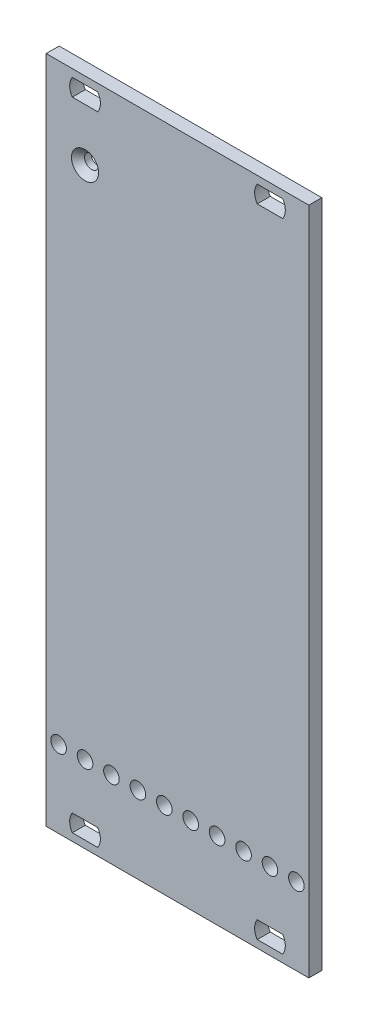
ISO-10303-21;
HEADER;
FILE_DESCRIPTION(('STEP AP214'),'2;1');
FILE_NAME('part.step','',(''),(''),'','','');
FILE_SCHEMA(('AUTOMOTIVE_DESIGN { 1 0 10303 214 1 1 1 1 }'));
ENDSEC;
DATA;
#1=APPLICATION_CONTEXT('core data for automotive mechanical design processes');
#2=APPLICATION_PROTOCOL_DEFINITION('international standard','automotive_design',2000,#1);
#3=PRODUCT_CONTEXT('',#1,'mechanical');
#4=PRODUCT('Part','Part','',(#3));
#5=PRODUCT_RELATED_PRODUCT_CATEGORY('part','',(#4));
#6=PRODUCT_DEFINITION_FORMATION('','',#4);
#7=PRODUCT_DEFINITION_CONTEXT('part definition',#1,'design');
#8=PRODUCT_DEFINITION('design','',#6,#7);
#9=PRODUCT_DEFINITION_SHAPE('','',#8);
#10=(LENGTH_UNIT() NAMED_UNIT(*) SI_UNIT(.MILLI.,.METRE.));
#11=(NAMED_UNIT(*) PLANE_ANGLE_UNIT() SI_UNIT($,.RADIAN.));
#12=(NAMED_UNIT(*) SI_UNIT($,.STERADIAN.) SOLID_ANGLE_UNIT());
#13=UNCERTAINTY_MEASURE_WITH_UNIT(LENGTH_MEASURE(1.E-05),#10,'distance_accuracy_value','');
#14=(GEOMETRIC_REPRESENTATION_CONTEXT(3) GLOBAL_UNCERTAINTY_ASSIGNED_CONTEXT((#13)) GLOBAL_UNIT_ASSIGNED_CONTEXT((#10,
#11,#12)) REPRESENTATION_CONTEXT('',''));
#15=CARTESIAN_POINT('',(0.,0.,0.));
#16=DIRECTION('',(0.,0.,1.));
#17=DIRECTION('',(1.,0.,0.));
#18=AXIS2_PLACEMENT_3D('',#15,#16,#17);
#19=CARTESIAN_POINT('',(25.25,64.35,-2.5));
#20=DIRECTION('',(1.,0.,0.));
#21=DIRECTION('',(0.,1.,0.));
#22=AXIS2_PLACEMENT_3D('',#19,#20,#21);
#23=PLANE('',#22);
#24=DIRECTION('',(0.,1.,0.));
#25=VECTOR('',#24,1.);
#26=CARTESIAN_POINT('',(25.25,64.35,0.));
#27=LINE('',#26,#25);
#28=CARTESIAN_POINT('',(25.25,-64.35,0.));
#29=VERTEX_POINT('',#28);
#30=CARTESIAN_POINT('',(25.25,64.35,0.));
#31=VERTEX_POINT('',#30);
#32=EDGE_CURVE('E336',#29,#31,#27,.T.);
#33=ORIENTED_EDGE('',*,*,#32,.F.);
#34=DIRECTION('',(0.,0.,1.));
#35=VECTOR('',#34,1.);
#36=CARTESIAN_POINT('',(25.25,-64.35,-2.5));
#37=LINE('',#36,#35);
#38=CARTESIAN_POINT('',(25.25,-64.35,-2.5));
#39=VERTEX_POINT('',#38);
#40=EDGE_CURVE('E361',#39,#29,#37,.T.);
#41=ORIENTED_EDGE('',*,*,#40,.F.);
#42=DIRECTION('',(0.,1.,0.));
#43=VECTOR('',#42,1.);
#44=CARTESIAN_POINT('',(25.25,64.35,-2.5));
#45=LINE('',#44,#43);
#46=CARTESIAN_POINT('',(25.25,64.35,-2.5));
#47=VERTEX_POINT('',#46);
#48=EDGE_CURVE('E337',#39,#47,#45,.T.);
#49=ORIENTED_EDGE('',*,*,#48,.T.);
#50=DIRECTION('',(0.,0.,1.));
#51=VECTOR('',#50,1.);
#52=CARTESIAN_POINT('',(25.25,64.35,-2.5));
#53=LINE('',#52,#51);
#54=EDGE_CURVE('E350',#47,#31,#53,.T.);
#55=ORIENTED_EDGE('',*,*,#54,.T.);
#56=EDGE_LOOP('',(#33,#41,#49,#55));
#57=FACE_BOUND('',#56,.T.);
#58=ADVANCED_FACE('F34',(#57),#23,.T.);
#59=CARTESIAN_POINT('',(-25.25,-64.35,-2.5));
#60=DIRECTION('',(0.,-1.,0.));
#61=DIRECTION('',(0.,0.,-1.));
#62=AXIS2_PLACEMENT_3D('',#59,#60,#61);
#63=PLANE('',#62);
#64=DIRECTION('',(1.,0.,0.));
#65=VECTOR('',#64,1.);
#66=CARTESIAN_POINT('',(-25.25,-64.35,0.));
#67=LINE('',#66,#65);
#68=CARTESIAN_POINT('',(-25.25,-64.35,0.));
#69=VERTEX_POINT('',#68);
#70=EDGE_CURVE('E341',#69,#29,#67,.T.);
#71=ORIENTED_EDGE('',*,*,#70,.F.);
#72=DIRECTION('',(0.,0.,1.));
#73=VECTOR('',#72,1.);
#74=CARTESIAN_POINT('',(-25.25,-64.35,-2.5));
#75=LINE('',#74,#73);
#76=CARTESIAN_POINT('',(-25.25,-64.35,-2.5));
#77=VERTEX_POINT('',#76);
#78=EDGE_CURVE('E363',#77,#69,#75,.T.);
#79=ORIENTED_EDGE('',*,*,#78,.F.);
#80=DIRECTION('',(1.,0.,0.));
#81=VECTOR('',#80,1.);
#82=CARTESIAN_POINT('',(-25.25,-64.35,-2.5));
#83=LINE('',#82,#81);
#84=EDGE_CURVE('E347',#77,#39,#83,.T.);
#85=ORIENTED_EDGE('',*,*,#84,.T.);
#86=ORIENTED_EDGE('',*,*,#40,.T.);
#87=EDGE_LOOP('',(#71,#79,#85,#86));
#88=FACE_BOUND('',#87,.T.);
#89=ADVANCED_FACE('F382',(#88),#63,.T.);
#90=CARTESIAN_POINT('',(-25.25,64.35,-2.5));
#91=DIRECTION('',(-1.,0.,0.));
#92=DIRECTION('',(0.,-1.,0.));
#93=AXIS2_PLACEMENT_3D('',#90,#91,#92);
#94=PLANE('',#93);
#95=DIRECTION('',(0.,-1.,0.));
#96=VECTOR('',#95,1.);
#97=CARTESIAN_POINT('',(-25.25,64.35,0.));
#98=LINE('',#97,#96);
#99=CARTESIAN_POINT('',(-25.25,64.35,0.));
#100=VERTEX_POINT('',#99);
#101=EDGE_CURVE('E356',#100,#69,#98,.T.);
#102=ORIENTED_EDGE('',*,*,#101,.F.);
#103=DIRECTION('',(0.,0.,1.));
#104=VECTOR('',#103,1.);
#105=CARTESIAN_POINT('',(-25.25,64.35,-2.5));
#106=LINE('',#105,#104);
#107=CARTESIAN_POINT('',(-25.25,64.35,-2.5));
#108=VERTEX_POINT('',#107);
#109=EDGE_CURVE('E365',#108,#100,#106,.T.);
#110=ORIENTED_EDGE('',*,*,#109,.F.);
#111=DIRECTION('',(0.,-1.,0.));
#112=VECTOR('',#111,1.);
#113=CARTESIAN_POINT('',(-25.25,64.35,-2.5));
#114=LINE('',#113,#112);
#115=EDGE_CURVE('E344',#108,#77,#114,.T.);
#116=ORIENTED_EDGE('',*,*,#115,.T.);
#117=ORIENTED_EDGE('',*,*,#78,.T.);
#118=EDGE_LOOP('',(#102,#110,#116,#117));
#119=FACE_BOUND('',#118,.T.);
#120=ADVANCED_FACE('F387',(#119),#94,.T.);
#121=CARTESIAN_POINT('',(-25.25,64.35,-2.5));
#122=DIRECTION('',(0.,1.,0.));
#123=DIRECTION('',(0.,0.,1.));
#124=AXIS2_PLACEMENT_3D('',#121,#122,#123);
#125=PLANE('',#124);
#126=DIRECTION('',(-1.,0.,0.));
#127=VECTOR('',#126,1.);
#128=CARTESIAN_POINT('',(-25.25,64.35,0.));
#129=LINE('',#128,#127);
#130=EDGE_CURVE('E353',#31,#100,#129,.T.);
#131=ORIENTED_EDGE('',*,*,#130,.F.);
#132=ORIENTED_EDGE('',*,*,#54,.F.);
#133=DIRECTION('',(-1.,0.,0.));
#134=VECTOR('',#133,1.);
#135=CARTESIAN_POINT('',(-25.25,64.35,-2.5));
#136=LINE('',#135,#134);
#137=EDGE_CURVE('E340',#47,#108,#136,.T.);
#138=ORIENTED_EDGE('',*,*,#137,.T.);
#139=ORIENTED_EDGE('',*,*,#109,.T.);
#140=EDGE_LOOP('',(#131,#132,#138,#139));
#141=FACE_BOUND('',#140,.T.);
#142=ADVANCED_FACE('F392',(#141),#125,.T.);
#143=CARTESIAN_POINT('',(0.,0.,-2.5));
#144=DIRECTION('',(0.,0.,1.));
#145=DIRECTION('',(1.,0.,0.));
#146=AXIS2_PLACEMENT_3D('',#143,#144,#145);
#147=PLANE('',#146);
#148=CARTESIAN_POINT('',(-17.78,49.5,-2.5));
#149=DIRECTION('',(0.,0.,1.));
#150=DIRECTION('',(1.,0.,0.));
#151=AXIS2_PLACEMENT_3D('',#148,#149,#150);
#152=CIRCLE('',#151,1.35);
#153=CARTESIAN_POINT('',(-16.43,49.5,-2.5));
#154=VERTEX_POINT('',#153);
#155=EDGE_CURVE('E518',#154,#154,#152,.F.);
#156=ORIENTED_EDGE('',*,*,#155,.F.);
#157=EDGE_LOOP('',(#156));
#158=FACE_BOUND('',#157,.T.);
#159=CARTESIAN_POINT('',(7.62000000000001,-49.5,-2.5));
#160=DIRECTION('',(0.,0.,1.));
#161=DIRECTION('',(1.,0.,0.));
#162=AXIS2_PLACEMENT_3D('',#159,#160,#161);
#163=CIRCLE('',#162,1.5);
#164=CARTESIAN_POINT('',(9.12000000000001,-49.5,-2.5));
#165=VERTEX_POINT('',#164);
#166=EDGE_CURVE('E511',#165,#165,#163,.F.);
#167=ORIENTED_EDGE('',*,*,#166,.F.);
#168=EDGE_LOOP('',(#167));
#169=FACE_BOUND('',#168,.T.);
#170=CARTESIAN_POINT('',(2.54000000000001,-49.5,-2.5));
#171=DIRECTION('',(0.,0.,1.));
#172=DIRECTION('',(1.,0.,0.));
#173=AXIS2_PLACEMENT_3D('',#170,#171,#172);
#174=CIRCLE('',#173,1.5);
#175=CARTESIAN_POINT('',(4.04000000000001,-49.5,-2.5));
#176=VERTEX_POINT('',#175);
#177=EDGE_CURVE('E516',#176,#176,#174,.F.);
#178=ORIENTED_EDGE('',*,*,#177,.F.);
#179=EDGE_LOOP('',(#178));
#180=FACE_BOUND('',#179,.T.);
#181=CARTESIAN_POINT('',(-2.53999999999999,-49.5,-2.5));
#182=DIRECTION('',(0.,0.,1.));
#183=DIRECTION('',(1.,0.,0.));
#184=AXIS2_PLACEMENT_3D('',#181,#182,#183);
#185=CIRCLE('',#184,1.5);
#186=CARTESIAN_POINT('',(-1.03999999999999,-49.5,-2.5));
#187=VERTEX_POINT('',#186);
#188=EDGE_CURVE('E527',#187,#187,#185,.F.);
#189=ORIENTED_EDGE('',*,*,#188,.F.);
#190=EDGE_LOOP('',(#189));
#191=FACE_BOUND('',#190,.T.);
#192=CARTESIAN_POINT('',(-7.61999999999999,-49.5,-2.5));
#193=DIRECTION('',(0.,0.,1.));
#194=DIRECTION('',(1.,0.,0.));
#195=AXIS2_PLACEMENT_3D('',#192,#193,#194);
#196=CIRCLE('',#195,1.5);
#197=CARTESIAN_POINT('',(-6.11999999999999,-49.5,-2.5));
#198=VERTEX_POINT('',#197);
#199=EDGE_CURVE('E533',#198,#198,#196,.F.);
#200=ORIENTED_EDGE('',*,*,#199,.F.);
#201=EDGE_LOOP('',(#200));
#202=FACE_BOUND('',#201,.T.);
#203=DIRECTION('',(-1.,0.,0.));
#204=VECTOR('',#203,1.);
#205=CARTESIAN_POINT('',(-20.2254038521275,-62.9,-2.5));
#206=LINE('',#205,#204);
#207=CARTESIAN_POINT('',(-15.3345961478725,-62.9,-2.5));
#208=VERTEX_POINT('',#207);
#209=CARTESIAN_POINT('',(-20.2254038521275,-62.9,-2.5));
#210=VERTEX_POINT('',#209);
#211=EDGE_CURVE('E191',#208,#210,#206,.T.);
#212=ORIENTED_EDGE('',*,*,#211,.F.);
#213=CARTESIAN_POINT('',(-17.78,-61.25,-2.5));
#214=DIRECTION('',(0.,0.,1.));
#215=DIRECTION('',(1.,0.,0.));
#216=AXIS2_PLACEMENT_3D('',#213,#214,#215);
#217=CIRCLE('',#216,2.95);
#218=CARTESIAN_POINT('',(-15.3345961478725,-59.6,-2.5));
#219=VERTEX_POINT('',#218);
#220=EDGE_CURVE('E173',#219,#208,#217,.F.);
#221=ORIENTED_EDGE('',*,*,#220,.F.);
#222=DIRECTION('',(1.,0.,0.));
#223=VECTOR('',#222,1.);
#224=CARTESIAN_POINT('',(-20.2254038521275,-59.6,-2.5));
#225=LINE('',#224,#223);
#226=CARTESIAN_POINT('',(-20.2254038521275,-59.6,-2.5));
#227=VERTEX_POINT('',#226);
#228=EDGE_CURVE('E182',#227,#219,#225,.T.);
#229=ORIENTED_EDGE('',*,*,#228,.F.);
#230=CARTESIAN_POINT('',(-17.78,-61.25,-2.5));
#231=DIRECTION('',(0.,0.,1.));
#232=DIRECTION('',(1.,0.,0.));
#233=AXIS2_PLACEMENT_3D('',#230,#231,#232);
#234=CIRCLE('',#233,2.95);
#235=EDGE_CURVE('E49',#210,#227,#234,.F.);
#236=ORIENTED_EDGE('',*,*,#235,.F.);
#237=EDGE_LOOP('',(#212,#221,#229,#236));
#238=FACE_BOUND('',#237,.T.);
#239=DIRECTION('',(-1.,0.,0.));
#240=VECTOR('',#239,1.);
#241=CARTESIAN_POINT('',(20.2254038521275,-62.9,-2.5));
#242=LINE('',#241,#240);
#243=CARTESIAN_POINT('',(20.2254038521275,-62.9,-2.5));
#244=VERTEX_POINT('',#243);
#245=CARTESIAN_POINT('',(15.3345961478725,-62.9,-2.5));
#246=VERTEX_POINT('',#245);
#247=EDGE_CURVE('E209',#244,#246,#242,.T.);
#248=ORIENTED_EDGE('',*,*,#247,.F.);
#249=CARTESIAN_POINT('',(17.78,-61.25,-2.5));
#250=DIRECTION('',(0.,0.,1.));
#251=DIRECTION('',(1.,0.,0.));
#252=AXIS2_PLACEMENT_3D('',#249,#250,#251);
#253=CIRCLE('',#252,2.95);
#254=CARTESIAN_POINT('',(20.2254038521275,-59.6,-2.5));
#255=VERTEX_POINT('',#254);
#256=EDGE_CURVE('E212',#255,#244,#253,.F.);
#257=ORIENTED_EDGE('',*,*,#256,.F.);
#258=DIRECTION('',(1.,0.,0.));
#259=VECTOR('',#258,1.);
#260=CARTESIAN_POINT('',(20.2254038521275,-59.6,-2.5));
#261=LINE('',#260,#259);
#262=CARTESIAN_POINT('',(15.3345961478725,-59.6,-2.5));
#263=VERTEX_POINT('',#262);
#264=EDGE_CURVE('E229',#263,#255,#261,.T.);
#265=ORIENTED_EDGE('',*,*,#264,.F.);
#266=CARTESIAN_POINT('',(17.78,-61.25,-2.5));
#267=DIRECTION('',(0.,0.,1.));
#268=DIRECTION('',(1.,0.,0.));
#269=AXIS2_PLACEMENT_3D('',#266,#267,#268);
#270=CIRCLE('',#269,2.95);
#271=EDGE_CURVE('E185',#246,#263,#270,.F.);
#272=ORIENTED_EDGE('',*,*,#271,.F.);
#273=EDGE_LOOP('',(#248,#257,#265,#272));
#274=FACE_BOUND('',#273,.T.);
#275=DIRECTION('',(-1.,0.,0.));
#276=VECTOR('',#275,1.);
#277=CARTESIAN_POINT('',(-20.2254038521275,59.6,-2.5));
#278=LINE('',#277,#276);
#279=CARTESIAN_POINT('',(-15.3345961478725,59.6,-2.5));
#280=VERTEX_POINT('',#279);
#281=CARTESIAN_POINT('',(-20.2254038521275,59.6,-2.5));
#282=VERTEX_POINT('',#281);
#283=EDGE_CURVE('E240',#280,#282,#278,.T.);
#284=ORIENTED_EDGE('',*,*,#283,.F.);
#285=CARTESIAN_POINT('',(-17.78,61.25,-2.5));
#286=DIRECTION('',(0.,0.,1.));
#287=DIRECTION('',(1.,0.,0.));
#288=AXIS2_PLACEMENT_3D('',#285,#286,#287);
#289=CIRCLE('',#288,2.95);
#290=CARTESIAN_POINT('',(-15.3345961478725,62.9,-2.5));
#291=VERTEX_POINT('',#290);
#292=EDGE_CURVE('E243',#291,#280,#289,.F.);
#293=ORIENTED_EDGE('',*,*,#292,.F.);
#294=DIRECTION('',(1.,0.,0.));
#295=VECTOR('',#294,1.);
#296=CARTESIAN_POINT('',(-20.2254038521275,62.9,-2.5));
#297=LINE('',#296,#295);
#298=CARTESIAN_POINT('',(-20.2254038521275,62.9,-2.5));
#299=VERTEX_POINT('',#298);
#300=EDGE_CURVE('E260',#299,#291,#297,.T.);
#301=ORIENTED_EDGE('',*,*,#300,.F.);
#302=CARTESIAN_POINT('',(-17.78,61.25,-2.5));
#303=DIRECTION('',(0.,0.,1.));
#304=DIRECTION('',(1.,0.,0.));
#305=AXIS2_PLACEMENT_3D('',#302,#303,#304);
#306=CIRCLE('',#305,2.95);
#307=EDGE_CURVE('E238',#282,#299,#306,.F.);
#308=ORIENTED_EDGE('',*,*,#307,.F.);
#309=EDGE_LOOP('',(#284,#293,#301,#308));
#310=FACE_BOUND('',#309,.T.);
#311=DIRECTION('',(1.,0.,0.));
#312=VECTOR('',#311,1.);
#313=CARTESIAN_POINT('',(20.2254038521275,62.9,-2.5));
#314=LINE('',#313,#312);
#315=CARTESIAN_POINT('',(15.3345961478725,62.9,-2.5));
#316=VERTEX_POINT('',#315);
#317=CARTESIAN_POINT('',(20.2254038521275,62.9,-2.5));
#318=VERTEX_POINT('',#317);
#319=EDGE_CURVE('E271',#316,#318,#314,.T.);
#320=ORIENTED_EDGE('',*,*,#319,.F.);
#321=CARTESIAN_POINT('',(17.78,61.25,-2.5));
#322=DIRECTION('',(0.,0.,1.));
#323=DIRECTION('',(1.,0.,0.));
#324=AXIS2_PLACEMENT_3D('',#321,#322,#323);
#325=CIRCLE('',#324,2.95);
#326=CARTESIAN_POINT('',(15.3345961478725,59.6,-2.5));
#327=VERTEX_POINT('',#326);
#328=EDGE_CURVE('E274',#327,#316,#325,.F.);
#329=ORIENTED_EDGE('',*,*,#328,.F.);
#330=DIRECTION('',(-1.,0.,0.));
#331=VECTOR('',#330,1.);
#332=CARTESIAN_POINT('',(20.2254038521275,59.6,-2.5));
#333=LINE('',#332,#331);
#334=CARTESIAN_POINT('',(20.2254038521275,59.6,-2.5));
#335=VERTEX_POINT('',#334);
#336=EDGE_CURVE('E291',#335,#327,#333,.T.);
#337=ORIENTED_EDGE('',*,*,#336,.F.);
#338=CARTESIAN_POINT('',(17.78,61.25,-2.5));
#339=DIRECTION('',(0.,0.,1.));
#340=DIRECTION('',(1.,0.,0.));
#341=AXIS2_PLACEMENT_3D('',#338,#339,#340);
#342=CIRCLE('',#341,2.95);
#343=EDGE_CURVE('E269',#318,#335,#342,.F.);
#344=ORIENTED_EDGE('',*,*,#343,.F.);
#345=EDGE_LOOP('',(#320,#329,#337,#344));
#346=FACE_BOUND('',#345,.T.);
#347=CARTESIAN_POINT('',(17.78,-49.5,-2.5));
#348=DIRECTION('',(0.,0.,1.));
#349=DIRECTION('',(1.,0.,0.));
#350=AXIS2_PLACEMENT_3D('',#347,#348,#349);
#351=CIRCLE('',#350,1.5);
#352=CARTESIAN_POINT('',(19.28,-49.5,-2.5));
#353=VERTEX_POINT('',#352);
#354=EDGE_CURVE('E303',#353,#353,#351,.F.);
#355=ORIENTED_EDGE('',*,*,#354,.F.);
#356=EDGE_LOOP('',(#355));
#357=FACE_BOUND('',#356,.T.);
#358=CARTESIAN_POINT('',(22.86,-49.5,-2.5));
#359=DIRECTION('',(0.,0.,1.));
#360=DIRECTION('',(1.,0.,0.));
#361=AXIS2_PLACEMENT_3D('',#358,#359,#360);
#362=CIRCLE('',#361,1.5);
#363=CARTESIAN_POINT('',(24.36,-49.5,-2.5));
#364=VERTEX_POINT('',#363);
#365=EDGE_CURVE('E309',#364,#364,#362,.F.);
#366=ORIENTED_EDGE('',*,*,#365,.F.);
#367=EDGE_LOOP('',(#366));
#368=FACE_BOUND('',#367,.T.);
#369=CARTESIAN_POINT('',(12.7,-49.5,-2.5));
#370=DIRECTION('',(0.,0.,1.));
#371=DIRECTION('',(1.,0.,0.));
#372=AXIS2_PLACEMENT_3D('',#369,#370,#371);
#373=CIRCLE('',#372,1.5);
#374=CARTESIAN_POINT('',(14.2,-49.5,-2.5));
#375=VERTEX_POINT('',#374);
#376=EDGE_CURVE('E315',#375,#375,#373,.F.);
#377=ORIENTED_EDGE('',*,*,#376,.F.);
#378=EDGE_LOOP('',(#377));
#379=FACE_BOUND('',#378,.T.);
#380=CARTESIAN_POINT('',(-12.7,-49.5,-2.5));
#381=DIRECTION('',(0.,0.,1.));
#382=DIRECTION('',(1.,0.,0.));
#383=AXIS2_PLACEMENT_3D('',#380,#381,#382);
#384=CIRCLE('',#383,1.5);
#385=CARTESIAN_POINT('',(-11.2,-49.5,-2.5));
#386=VERTEX_POINT('',#385);
#387=EDGE_CURVE('E321',#386,#386,#384,.F.);
#388=ORIENTED_EDGE('',*,*,#387,.F.);
#389=EDGE_LOOP('',(#388));
#390=FACE_BOUND('',#389,.T.);
#391=CARTESIAN_POINT('',(-22.86,-49.5,-2.5));
#392=DIRECTION('',(0.,0.,1.));
#393=DIRECTION('',(1.,0.,0.));
#394=AXIS2_PLACEMENT_3D('',#391,#392,#393);
#395=CIRCLE('',#394,1.5);
#396=CARTESIAN_POINT('',(-21.36,-49.5,-2.5));
#397=VERTEX_POINT('',#396);
#398=EDGE_CURVE('E327',#397,#397,#395,.F.);
#399=ORIENTED_EDGE('',*,*,#398,.F.);
#400=EDGE_LOOP('',(#399));
#401=FACE_BOUND('',#400,.T.);
#402=CARTESIAN_POINT('',(-17.78,-49.5,-2.5));
#403=DIRECTION('',(0.,0.,1.));
#404=DIRECTION('',(1.,0.,0.));
#405=AXIS2_PLACEMENT_3D('',#402,#403,#404);
#406=CIRCLE('',#405,1.5);
#407=CARTESIAN_POINT('',(-16.28,-49.5,-2.5));
#408=VERTEX_POINT('',#407);
#409=EDGE_CURVE('E333',#408,#408,#406,.F.);
#410=ORIENTED_EDGE('',*,*,#409,.F.);
#411=EDGE_LOOP('',(#410));
#412=FACE_BOUND('',#411,.T.);
#413=ORIENTED_EDGE('',*,*,#48,.F.);
#414=ORIENTED_EDGE('',*,*,#84,.F.);
#415=ORIENTED_EDGE('',*,*,#115,.F.);
#416=ORIENTED_EDGE('',*,*,#137,.F.);
#417=EDGE_LOOP('',(#413,#414,#415,#416));
#418=FACE_BOUND('',#417,.T.);
#419=ADVANCED_FACE('F188',(#158,#169,#180,#191,#202,#238,#274,#310,#346,#357,#368,#379,#390,
#401,#412,#418),#147,.F.);
#420=CARTESIAN_POINT('',(0.,0.,0.));
#421=DIRECTION('',(0.,0.,1.));
#422=DIRECTION('',(1.,0.,0.));
#423=AXIS2_PLACEMENT_3D('',#420,#421,#422);
#424=PLANE('',#423);
#425=CARTESIAN_POINT('',(-17.78,49.5,0.));
#426=DIRECTION('',(0.,0.,1.));
#427=DIRECTION('',(1.,0.,0.));
#428=AXIS2_PLACEMENT_3D('',#425,#426,#427);
#429=CIRCLE('',#428,2.60000000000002);
#430=CARTESIAN_POINT('',(-15.18,49.5,0.));
#431=VERTEX_POINT('',#430);
#432=EDGE_CURVE('E11',#431,#431,#429,.F.);
#433=ORIENTED_EDGE('',*,*,#432,.T.);
#434=EDGE_LOOP('',(#433));
#435=FACE_BOUND('',#434,.T.);
#436=CARTESIAN_POINT('',(7.62000000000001,-49.5,0.));
#437=DIRECTION('',(0.,0.,1.));
#438=DIRECTION('',(1.,0.,0.));
#439=AXIS2_PLACEMENT_3D('',#436,#437,#438);
#440=CIRCLE('',#439,1.5);
#441=CARTESIAN_POINT('',(9.12000000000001,-49.5,0.));
#442=VERTEX_POINT('',#441);
#443=EDGE_CURVE('E508',#442,#442,#440,.T.);
#444=ORIENTED_EDGE('',*,*,#443,.F.);
#445=EDGE_LOOP('',(#444));
#446=FACE_BOUND('',#445,.T.);
#447=CARTESIAN_POINT('',(2.54000000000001,-49.5,0.));
#448=DIRECTION('',(0.,0.,1.));
#449=DIRECTION('',(1.,0.,0.));
#450=AXIS2_PLACEMENT_3D('',#447,#448,#449);
#451=CIRCLE('',#450,1.5);
#452=CARTESIAN_POINT('',(4.04000000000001,-49.5,0.));
#453=VERTEX_POINT('',#452);
#454=EDGE_CURVE('E513',#453,#453,#451,.T.);
#455=ORIENTED_EDGE('',*,*,#454,.F.);
#456=EDGE_LOOP('',(#455));
#457=FACE_BOUND('',#456,.T.);
#458=CARTESIAN_POINT('',(-2.53999999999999,-49.5,0.));
#459=DIRECTION('',(0.,0.,1.));
#460=DIRECTION('',(1.,0.,0.));
#461=AXIS2_PLACEMENT_3D('',#458,#459,#460);
#462=CIRCLE('',#461,1.5);
#463=CARTESIAN_POINT('',(-1.03999999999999,-49.5,0.));
#464=VERTEX_POINT('',#463);
#465=EDGE_CURVE('E524',#464,#464,#462,.T.);
#466=ORIENTED_EDGE('',*,*,#465,.F.);
#467=EDGE_LOOP('',(#466));
#468=FACE_BOUND('',#467,.T.);
#469=CARTESIAN_POINT('',(-7.61999999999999,-49.5,0.));
#470=DIRECTION('',(0.,0.,1.));
#471=DIRECTION('',(1.,0.,0.));
#472=AXIS2_PLACEMENT_3D('',#469,#470,#471);
#473=CIRCLE('',#472,1.5);
#474=CARTESIAN_POINT('',(-6.11999999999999,-49.5,0.));
#475=VERTEX_POINT('',#474);
#476=EDGE_CURVE('E530',#475,#475,#473,.T.);
#477=ORIENTED_EDGE('',*,*,#476,.F.);
#478=EDGE_LOOP('',(#477));
#479=FACE_BOUND('',#478,.T.);
#480=CARTESIAN_POINT('',(-17.78,-61.25,0.));
#481=DIRECTION('',(0.,0.,1.));
#482=DIRECTION('',(-1.,0.,0.));
#483=AXIS2_PLACEMENT_3D('',#480,#481,#482);
#484=CIRCLE('',#483,2.95);
#485=CARTESIAN_POINT('',(-15.3345961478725,-62.9,0.));
#486=VERTEX_POINT('',#485);
#487=CARTESIAN_POINT('',(-15.3345961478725,-59.6,0.));
#488=VERTEX_POINT('',#487);
#489=EDGE_CURVE('E57',#486,#488,#484,.T.);
#490=ORIENTED_EDGE('',*,*,#489,.F.);
#491=DIRECTION('',(1.,0.,0.));
#492=VECTOR('',#491,1.);
#493=CARTESIAN_POINT('',(-20.2254038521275,-62.9,0.));
#494=LINE('',#493,#492);
#495=CARTESIAN_POINT('',(-20.2254038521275,-62.9,0.));
#496=VERTEX_POINT('',#495);
#497=EDGE_CURVE('E179',#496,#486,#494,.T.);
#498=ORIENTED_EDGE('',*,*,#497,.F.);
#499=CARTESIAN_POINT('',(-17.78,-61.25,0.));
#500=DIRECTION('',(0.,0.,1.));
#501=DIRECTION('',(-1.,0.,0.));
#502=AXIS2_PLACEMENT_3D('',#499,#500,#501);
#503=CIRCLE('',#502,2.95);
#504=CARTESIAN_POINT('',(-20.2254038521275,-59.6,0.));
#505=VERTEX_POINT('',#504);
#506=EDGE_CURVE('E199',#505,#496,#503,.T.);
#507=ORIENTED_EDGE('',*,*,#506,.F.);
#508=DIRECTION('',(-1.,0.,0.));
#509=VECTOR('',#508,1.);
#510=CARTESIAN_POINT('',(-20.2254038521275,-59.6,0.));
#511=LINE('',#510,#509);
#512=EDGE_CURVE('E193',#488,#505,#511,.T.);
#513=ORIENTED_EDGE('',*,*,#512,.F.);
#514=EDGE_LOOP('',(#490,#498,#507,#513));
#515=FACE_BOUND('',#514,.T.);
#516=CARTESIAN_POINT('',(17.78,-61.25,0.));
#517=DIRECTION('',(0.,0.,1.));
#518=DIRECTION('',(1.,0.,0.));
#519=AXIS2_PLACEMENT_3D('',#516,#517,#518);
#520=CIRCLE('',#519,2.95);
#521=CARTESIAN_POINT('',(20.2254038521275,-62.9,0.));
#522=VERTEX_POINT('',#521);
#523=CARTESIAN_POINT('',(20.2254038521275,-59.6,0.));
#524=VERTEX_POINT('',#523);
#525=EDGE_CURVE('E215',#522,#524,#520,.T.);
#526=ORIENTED_EDGE('',*,*,#525,.F.);
#527=DIRECTION('',(1.,0.,0.));
#528=VECTOR('',#527,1.);
#529=CARTESIAN_POINT('',(20.2254038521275,-62.9,0.));
#530=LINE('',#529,#528);
#531=CARTESIAN_POINT('',(15.3345961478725,-62.9,0.));
#532=VERTEX_POINT('',#531);
#533=EDGE_CURVE('E223',#532,#522,#530,.T.);
#534=ORIENTED_EDGE('',*,*,#533,.F.);
#535=CARTESIAN_POINT('',(17.78,-61.25,0.));
#536=DIRECTION('',(0.,0.,1.));
#537=DIRECTION('',(1.,0.,0.));
#538=AXIS2_PLACEMENT_3D('',#535,#536,#537);
#539=CIRCLE('',#538,2.95);
#540=CARTESIAN_POINT('',(15.3345961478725,-59.6,0.));
#541=VERTEX_POINT('',#540);
#542=EDGE_CURVE('E220',#541,#532,#539,.T.);
#543=ORIENTED_EDGE('',*,*,#542,.F.);
#544=DIRECTION('',(-1.,0.,0.));
#545=VECTOR('',#544,1.);
#546=CARTESIAN_POINT('',(20.2254038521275,-59.6,0.));
#547=LINE('',#546,#545);
#548=EDGE_CURVE('E217',#524,#541,#547,.T.);
#549=ORIENTED_EDGE('',*,*,#548,.F.);
#550=EDGE_LOOP('',(#526,#534,#543,#549));
#551=FACE_BOUND('',#550,.T.);
#552=CARTESIAN_POINT('',(-17.78,61.25,0.));
#553=DIRECTION('',(0.,0.,1.));
#554=DIRECTION('',(1.,0.,0.));
#555=AXIS2_PLACEMENT_3D('',#552,#553,#554);
#556=CIRCLE('',#555,2.95);
#557=CARTESIAN_POINT('',(-15.3345961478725,59.6,0.));
#558=VERTEX_POINT('',#557);
#559=CARTESIAN_POINT('',(-15.3345961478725,62.9,0.));
#560=VERTEX_POINT('',#559);
#561=EDGE_CURVE('E246',#558,#560,#556,.T.);
#562=ORIENTED_EDGE('',*,*,#561,.F.);
#563=DIRECTION('',(1.,0.,0.));
#564=VECTOR('',#563,1.);
#565=CARTESIAN_POINT('',(-20.2254038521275,59.6,0.));
#566=LINE('',#565,#564);
#567=CARTESIAN_POINT('',(-20.2254038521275,59.6,0.));
#568=VERTEX_POINT('',#567);
#569=EDGE_CURVE('E254',#568,#558,#566,.T.);
#570=ORIENTED_EDGE('',*,*,#569,.F.);
#571=CARTESIAN_POINT('',(-17.78,61.25,0.));
#572=DIRECTION('',(0.,0.,1.));
#573=DIRECTION('',(1.,0.,0.));
#574=AXIS2_PLACEMENT_3D('',#571,#572,#573);
#575=CIRCLE('',#574,2.95);
#576=CARTESIAN_POINT('',(-20.2254038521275,62.9,0.));
#577=VERTEX_POINT('',#576);
#578=EDGE_CURVE('E251',#577,#568,#575,.T.);
#579=ORIENTED_EDGE('',*,*,#578,.F.);
#580=DIRECTION('',(-1.,0.,0.));
#581=VECTOR('',#580,1.);
#582=CARTESIAN_POINT('',(-20.2254038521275,62.9,0.));
#583=LINE('',#582,#581);
#584=EDGE_CURVE('E248',#560,#577,#583,.T.);
#585=ORIENTED_EDGE('',*,*,#584,.F.);
#586=EDGE_LOOP('',(#562,#570,#579,#585));
#587=FACE_BOUND('',#586,.T.);
#588=CARTESIAN_POINT('',(17.78,61.25,0.));
#589=DIRECTION('',(0.,0.,1.));
#590=DIRECTION('',(-1.,0.,0.));
#591=AXIS2_PLACEMENT_3D('',#588,#589,#590);
#592=CIRCLE('',#591,2.95);
#593=CARTESIAN_POINT('',(15.3345961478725,62.9,0.));
#594=VERTEX_POINT('',#593);
#595=CARTESIAN_POINT('',(15.3345961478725,59.6,0.));
#596=VERTEX_POINT('',#595);
#597=EDGE_CURVE('E277',#594,#596,#592,.T.);
#598=ORIENTED_EDGE('',*,*,#597,.F.);
#599=DIRECTION('',(-1.,0.,0.));
#600=VECTOR('',#599,1.);
#601=CARTESIAN_POINT('',(20.2254038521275,62.9,0.));
#602=LINE('',#601,#600);
#603=CARTESIAN_POINT('',(20.2254038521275,62.9,0.));
#604=VERTEX_POINT('',#603);
#605=EDGE_CURVE('E285',#604,#594,#602,.T.);
#606=ORIENTED_EDGE('',*,*,#605,.F.);
#607=CARTESIAN_POINT('',(17.78,61.25,0.));
#608=DIRECTION('',(0.,0.,1.));
#609=DIRECTION('',(-1.,0.,0.));
#610=AXIS2_PLACEMENT_3D('',#607,#608,#609);
#611=CIRCLE('',#610,2.95);
#612=CARTESIAN_POINT('',(20.2254038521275,59.6,0.));
#613=VERTEX_POINT('',#612);
#614=EDGE_CURVE('E282',#613,#604,#611,.T.);
#615=ORIENTED_EDGE('',*,*,#614,.F.);
#616=DIRECTION('',(1.,0.,0.));
#617=VECTOR('',#616,1.);
#618=CARTESIAN_POINT('',(20.2254038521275,59.6,0.));
#619=LINE('',#618,#617);
#620=EDGE_CURVE('E279',#596,#613,#619,.T.);
#621=ORIENTED_EDGE('',*,*,#620,.F.);
#622=EDGE_LOOP('',(#598,#606,#615,#621));
#623=FACE_BOUND('',#622,.T.);
#624=CARTESIAN_POINT('',(17.78,-49.5,0.));
#625=DIRECTION('',(0.,0.,1.));
#626=DIRECTION('',(-1.,0.,0.));
#627=AXIS2_PLACEMENT_3D('',#624,#625,#626);
#628=CIRCLE('',#627,1.5);
#629=CARTESIAN_POINT('',(16.28,-49.5,0.));
#630=VERTEX_POINT('',#629);
#631=EDGE_CURVE('E300',#630,#630,#628,.T.);
#632=ORIENTED_EDGE('',*,*,#631,.F.);
#633=EDGE_LOOP('',(#632));
#634=FACE_BOUND('',#633,.T.);
#635=CARTESIAN_POINT('',(22.86,-49.5,0.));
#636=DIRECTION('',(0.,0.,1.));
#637=DIRECTION('',(-1.,0.,0.));
#638=AXIS2_PLACEMENT_3D('',#635,#636,#637);
#639=CIRCLE('',#638,1.5);
#640=CARTESIAN_POINT('',(21.36,-49.5,0.));
#641=VERTEX_POINT('',#640);
#642=EDGE_CURVE('E306',#641,#641,#639,.T.);
#643=ORIENTED_EDGE('',*,*,#642,.F.);
#644=EDGE_LOOP('',(#643));
#645=FACE_BOUND('',#644,.T.);
#646=CARTESIAN_POINT('',(12.7,-49.5,0.));
#647=DIRECTION('',(0.,0.,1.));
#648=DIRECTION('',(-1.,0.,0.));
#649=AXIS2_PLACEMENT_3D('',#646,#647,#648);
#650=CIRCLE('',#649,1.5);
#651=CARTESIAN_POINT('',(11.2,-49.5,0.));
#652=VERTEX_POINT('',#651);
#653=EDGE_CURVE('E312',#652,#652,#650,.T.);
#654=ORIENTED_EDGE('',*,*,#653,.F.);
#655=EDGE_LOOP('',(#654));
#656=FACE_BOUND('',#655,.T.);
#657=CARTESIAN_POINT('',(-12.7,-49.5,0.));
#658=DIRECTION('',(0.,0.,1.));
#659=DIRECTION('',(1.,0.,0.));
#660=AXIS2_PLACEMENT_3D('',#657,#658,#659);
#661=CIRCLE('',#660,1.5);
#662=CARTESIAN_POINT('',(-11.2,-49.5,0.));
#663=VERTEX_POINT('',#662);
#664=EDGE_CURVE('E318',#663,#663,#661,.T.);
#665=ORIENTED_EDGE('',*,*,#664,.F.);
#666=EDGE_LOOP('',(#665));
#667=FACE_BOUND('',#666,.T.);
#668=CARTESIAN_POINT('',(-22.86,-49.5,0.));
#669=DIRECTION('',(0.,0.,1.));
#670=DIRECTION('',(1.,0.,0.));
#671=AXIS2_PLACEMENT_3D('',#668,#669,#670);
#672=CIRCLE('',#671,1.5);
#673=CARTESIAN_POINT('',(-21.36,-49.5,0.));
#674=VERTEX_POINT('',#673);
#675=EDGE_CURVE('E324',#674,#674,#672,.T.);
#676=ORIENTED_EDGE('',*,*,#675,.F.);
#677=EDGE_LOOP('',(#676));
#678=FACE_BOUND('',#677,.T.);
#679=CARTESIAN_POINT('',(-17.78,-49.5,0.));
#680=DIRECTION('',(0.,0.,1.));
#681=DIRECTION('',(1.,0.,0.));
#682=AXIS2_PLACEMENT_3D('',#679,#680,#681);
#683=CIRCLE('',#682,1.5);
#684=CARTESIAN_POINT('',(-16.28,-49.5,0.));
#685=VERTEX_POINT('',#684);
#686=EDGE_CURVE('E330',#685,#685,#683,.T.);
#687=ORIENTED_EDGE('',*,*,#686,.F.);
#688=EDGE_LOOP('',(#687));
#689=FACE_BOUND('',#688,.T.);
#690=ORIENTED_EDGE('',*,*,#32,.T.);
#691=ORIENTED_EDGE('',*,*,#130,.T.);
#692=ORIENTED_EDGE('',*,*,#101,.T.);
#693=ORIENTED_EDGE('',*,*,#70,.T.);
#694=EDGE_LOOP('',(#690,#691,#692,#693));
#695=FACE_BOUND('',#694,.T.);
#696=ADVANCED_FACE('F399',(#435,#446,#457,#468,#479,#515,#551,#587,#623,#634,#645,#656,#667,
#678,#689,#695),#424,.T.);
#697=CARTESIAN_POINT('',(-17.78,-49.5,-2.501));
#698=DIRECTION('',(0.,0.,1.));
#699=DIRECTION('',(1.,0.,0.));
#700=AXIS2_PLACEMENT_3D('',#697,#698,#699);
#701=CYLINDRICAL_SURFACE('',#700,1.5);
#702=ORIENTED_EDGE('',*,*,#686,.T.);
#703=EDGE_LOOP('',(#702));
#704=FACE_BOUND('',#703,.T.);
#705=ORIENTED_EDGE('',*,*,#409,.T.);
#706=EDGE_LOOP('',(#705));
#707=FACE_BOUND('',#706,.T.);
#708=ADVANCED_FACE('F402',(#704,#707),#701,.F.);
#709=CARTESIAN_POINT('',(-22.86,-49.5,-2.501));
#710=DIRECTION('',(0.,0.,1.));
#711=DIRECTION('',(1.,0.,0.));
#712=AXIS2_PLACEMENT_3D('',#709,#710,#711);
#713=CYLINDRICAL_SURFACE('',#712,1.5);
#714=ORIENTED_EDGE('',*,*,#675,.T.);
#715=EDGE_LOOP('',(#714));
#716=FACE_BOUND('',#715,.T.);
#717=ORIENTED_EDGE('',*,*,#398,.T.);
#718=EDGE_LOOP('',(#717));
#719=FACE_BOUND('',#718,.T.);
#720=ADVANCED_FACE('F409',(#716,#719),#713,.F.);
#721=CARTESIAN_POINT('',(-12.7,-49.5,-2.501));
#722=DIRECTION('',(0.,0.,1.));
#723=DIRECTION('',(1.,0.,0.));
#724=AXIS2_PLACEMENT_3D('',#721,#722,#723);
#725=CYLINDRICAL_SURFACE('',#724,1.5);
#726=ORIENTED_EDGE('',*,*,#664,.T.);
#727=EDGE_LOOP('',(#726));
#728=FACE_BOUND('',#727,.T.);
#729=ORIENTED_EDGE('',*,*,#387,.T.);
#730=EDGE_LOOP('',(#729));
#731=FACE_BOUND('',#730,.T.);
#732=ADVANCED_FACE('F413',(#728,#731),#725,.F.);
#733=CARTESIAN_POINT('',(12.7,-49.5,-2.501));
#734=DIRECTION('',(0.,0.,1.));
#735=DIRECTION('',(1.,0.,0.));
#736=AXIS2_PLACEMENT_3D('',#733,#734,#735);
#737=CYLINDRICAL_SURFACE('',#736,1.5);
#738=ORIENTED_EDGE('',*,*,#653,.T.);
#739=EDGE_LOOP('',(#738));
#740=FACE_BOUND('',#739,.T.);
#741=ORIENTED_EDGE('',*,*,#376,.T.);
#742=EDGE_LOOP('',(#741));
#743=FACE_BOUND('',#742,.T.);
#744=ADVANCED_FACE('F417',(#740,#743),#737,.F.);
#745=CARTESIAN_POINT('',(22.86,-49.5,-2.501));
#746=DIRECTION('',(0.,0.,1.));
#747=DIRECTION('',(1.,0.,0.));
#748=AXIS2_PLACEMENT_3D('',#745,#746,#747);
#749=CYLINDRICAL_SURFACE('',#748,1.5);
#750=ORIENTED_EDGE('',*,*,#642,.T.);
#751=EDGE_LOOP('',(#750));
#752=FACE_BOUND('',#751,.T.);
#753=ORIENTED_EDGE('',*,*,#365,.T.);
#754=EDGE_LOOP('',(#753));
#755=FACE_BOUND('',#754,.T.);
#756=ADVANCED_FACE('F421',(#752,#755),#749,.F.);
#757=CARTESIAN_POINT('',(17.78,-49.5,-2.501));
#758=DIRECTION('',(0.,0.,1.));
#759=DIRECTION('',(1.,0.,0.));
#760=AXIS2_PLACEMENT_3D('',#757,#758,#759);
#761=CYLINDRICAL_SURFACE('',#760,1.5);
#762=ORIENTED_EDGE('',*,*,#631,.T.);
#763=EDGE_LOOP('',(#762));
#764=FACE_BOUND('',#763,.T.);
#765=ORIENTED_EDGE('',*,*,#354,.T.);
#766=EDGE_LOOP('',(#765));
#767=FACE_BOUND('',#766,.T.);
#768=ADVANCED_FACE('F425',(#764,#767),#761,.F.);
#769=CARTESIAN_POINT('',(17.78,61.25,-2.501));
#770=DIRECTION('',(0.,0.,1.));
#771=DIRECTION('',(1.,0.,0.));
#772=AXIS2_PLACEMENT_3D('',#769,#770,#771);
#773=CYLINDRICAL_SURFACE('',#772,2.95);
#774=ORIENTED_EDGE('',*,*,#328,.T.);
#775=DIRECTION('',(0.,0.,1.));
#776=VECTOR('',#775,1.);
#777=CARTESIAN_POINT('',(15.3345961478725,62.9,-2.501));
#778=LINE('',#777,#776);
#779=EDGE_CURVE('E289',#316,#594,#778,.T.);
#780=ORIENTED_EDGE('',*,*,#779,.T.);
#781=ORIENTED_EDGE('',*,*,#597,.T.);
#782=DIRECTION('',(0.,0.,1.));
#783=VECTOR('',#782,1.);
#784=CARTESIAN_POINT('',(15.3345961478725,59.6,-2.501));
#785=LINE('',#784,#783);
#786=EDGE_CURVE('E288',#327,#596,#785,.T.);
#787=ORIENTED_EDGE('',*,*,#786,.F.);
#788=EDGE_LOOP('',(#774,#780,#781,#787));
#789=FACE_BOUND('',#788,.T.);
#790=ADVANCED_FACE('F429',(#789),#773,.F.);
#791=CARTESIAN_POINT('',(20.2254038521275,62.9,-2.501));
#792=DIRECTION('',(0.,1.,0.));
#793=DIRECTION('',(0.,0.,1.));
#794=AXIS2_PLACEMENT_3D('',#791,#792,#793);
#795=PLANE('',#794);
#796=ORIENTED_EDGE('',*,*,#319,.T.);
#797=DIRECTION('',(0.,0.,1.));
#798=VECTOR('',#797,1.);
#799=CARTESIAN_POINT('',(20.2254038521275,62.9,-2.501));
#800=LINE('',#799,#798);
#801=EDGE_CURVE('E292',#318,#604,#800,.T.);
#802=ORIENTED_EDGE('',*,*,#801,.T.);
#803=ORIENTED_EDGE('',*,*,#605,.T.);
#804=ORIENTED_EDGE('',*,*,#779,.F.);
#805=EDGE_LOOP('',(#796,#802,#803,#804));
#806=FACE_BOUND('',#805,.T.);
#807=ADVANCED_FACE('F433',(#806),#795,.F.);
#808=CARTESIAN_POINT('',(17.78,61.25,-2.501));
#809=DIRECTION('',(0.,0.,1.));
#810=DIRECTION('',(1.,0.,0.));
#811=AXIS2_PLACEMENT_3D('',#808,#809,#810);
#812=CYLINDRICAL_SURFACE('',#811,2.95);
#813=ORIENTED_EDGE('',*,*,#343,.T.);
#814=DIRECTION('',(0.,0.,1.));
#815=VECTOR('',#814,1.);
#816=CARTESIAN_POINT('',(20.2254038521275,59.6,-2.501));
#817=LINE('',#816,#815);
#818=EDGE_CURVE('E294',#335,#613,#817,.T.);
#819=ORIENTED_EDGE('',*,*,#818,.T.);
#820=ORIENTED_EDGE('',*,*,#614,.T.);
#821=ORIENTED_EDGE('',*,*,#801,.F.);
#822=EDGE_LOOP('',(#813,#819,#820,#821));
#823=FACE_BOUND('',#822,.T.);
#824=ADVANCED_FACE('F439',(#823),#812,.F.);
#825=CARTESIAN_POINT('',(20.2254038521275,59.6,-2.501));
#826=DIRECTION('',(0.,-1.,0.));
#827=DIRECTION('',(0.,0.,-1.));
#828=AXIS2_PLACEMENT_3D('',#825,#826,#827);
#829=PLANE('',#828);
#830=ORIENTED_EDGE('',*,*,#336,.T.);
#831=ORIENTED_EDGE('',*,*,#786,.T.);
#832=ORIENTED_EDGE('',*,*,#620,.T.);
#833=ORIENTED_EDGE('',*,*,#818,.F.);
#834=EDGE_LOOP('',(#830,#831,#832,#833));
#835=FACE_BOUND('',#834,.T.);
#836=ADVANCED_FACE('F435',(#835),#829,.F.);
#837=CARTESIAN_POINT('',(-17.78,61.25,-2.501));
#838=DIRECTION('',(0.,0.,1.));
#839=DIRECTION('',(1.,0.,0.));
#840=AXIS2_PLACEMENT_3D('',#837,#838,#839);
#841=CYLINDRICAL_SURFACE('',#840,2.95);
#842=ORIENTED_EDGE('',*,*,#292,.T.);
#843=DIRECTION('',(0.,0.,1.));
#844=VECTOR('',#843,1.);
#845=CARTESIAN_POINT('',(-15.3345961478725,59.6,-2.501));
#846=LINE('',#845,#844);
#847=EDGE_CURVE('E258',#280,#558,#846,.T.);
#848=ORIENTED_EDGE('',*,*,#847,.T.);
#849=ORIENTED_EDGE('',*,*,#561,.T.);
#850=DIRECTION('',(0.,0.,1.));
#851=VECTOR('',#850,1.);
#852=CARTESIAN_POINT('',(-15.3345961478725,62.9,-2.501));
#853=LINE('',#852,#851);
#854=EDGE_CURVE('E257',#291,#560,#853,.T.);
#855=ORIENTED_EDGE('',*,*,#854,.F.);
#856=EDGE_LOOP('',(#842,#848,#849,#855));
#857=FACE_BOUND('',#856,.T.);
#858=ADVANCED_FACE('F438',(#857),#841,.F.);
#859=CARTESIAN_POINT('',(-20.2254038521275,59.6,-2.501));
#860=DIRECTION('',(0.,-1.,0.));
#861=DIRECTION('',(0.,0.,-1.));
#862=AXIS2_PLACEMENT_3D('',#859,#860,#861);
#863=PLANE('',#862);
#864=ORIENTED_EDGE('',*,*,#283,.T.);
#865=DIRECTION('',(0.,0.,1.));
#866=VECTOR('',#865,1.);
#867=CARTESIAN_POINT('',(-20.2254038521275,59.6,-2.501));
#868=LINE('',#867,#866);
#869=EDGE_CURVE('E261',#282,#568,#868,.T.);
#870=ORIENTED_EDGE('',*,*,#869,.T.);
#871=ORIENTED_EDGE('',*,*,#569,.T.);
#872=ORIENTED_EDGE('',*,*,#847,.F.);
#873=EDGE_LOOP('',(#864,#870,#871,#872));
#874=FACE_BOUND('',#873,.T.);
#875=ADVANCED_FACE('F449',(#874),#863,.F.);
#876=CARTESIAN_POINT('',(-17.78,61.25,-2.501));
#877=DIRECTION('',(0.,0.,1.));
#878=DIRECTION('',(1.,0.,0.));
#879=AXIS2_PLACEMENT_3D('',#876,#877,#878);
#880=CYLINDRICAL_SURFACE('',#879,2.95);
#881=ORIENTED_EDGE('',*,*,#307,.T.);
#882=DIRECTION('',(0.,0.,1.));
#883=VECTOR('',#882,1.);
#884=CARTESIAN_POINT('',(-20.2254038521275,62.9,-2.501));
#885=LINE('',#884,#883);
#886=EDGE_CURVE('E263',#299,#577,#885,.T.);
#887=ORIENTED_EDGE('',*,*,#886,.T.);
#888=ORIENTED_EDGE('',*,*,#578,.T.);
#889=ORIENTED_EDGE('',*,*,#869,.F.);
#890=EDGE_LOOP('',(#881,#887,#888,#889));
#891=FACE_BOUND('',#890,.T.);
#892=ADVANCED_FACE('F455',(#891),#880,.F.);
#893=CARTESIAN_POINT('',(-20.2254038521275,62.9,-2.501));
#894=DIRECTION('',(0.,1.,0.));
#895=DIRECTION('',(0.,0.,1.));
#896=AXIS2_PLACEMENT_3D('',#893,#894,#895);
#897=PLANE('',#896);
#898=ORIENTED_EDGE('',*,*,#300,.T.);
#899=ORIENTED_EDGE('',*,*,#854,.T.);
#900=ORIENTED_EDGE('',*,*,#584,.T.);
#901=ORIENTED_EDGE('',*,*,#886,.F.);
#902=EDGE_LOOP('',(#898,#899,#900,#901));
#903=FACE_BOUND('',#902,.T.);
#904=ADVANCED_FACE('F451',(#903),#897,.F.);
#905=CARTESIAN_POINT('',(17.78,-61.25,-2.501));
#906=DIRECTION('',(0.,0.,1.));
#907=DIRECTION('',(1.,0.,0.));
#908=AXIS2_PLACEMENT_3D('',#905,#906,#907);
#909=CYLINDRICAL_SURFACE('',#908,2.95);
#910=ORIENTED_EDGE('',*,*,#256,.T.);
#911=DIRECTION('',(0.,0.,1.));
#912=VECTOR('',#911,1.);
#913=CARTESIAN_POINT('',(20.2254038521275,-62.9,-2.501));
#914=LINE('',#913,#912);
#915=EDGE_CURVE('E227',#244,#522,#914,.T.);
#916=ORIENTED_EDGE('',*,*,#915,.T.);
#917=ORIENTED_EDGE('',*,*,#525,.T.);
#918=DIRECTION('',(0.,0.,1.));
#919=VECTOR('',#918,1.);
#920=CARTESIAN_POINT('',(20.2254038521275,-59.6,-2.501));
#921=LINE('',#920,#919);
#922=EDGE_CURVE('E226',#255,#524,#921,.T.);
#923=ORIENTED_EDGE('',*,*,#922,.F.);
#924=EDGE_LOOP('',(#910,#916,#917,#923));
#925=FACE_BOUND('',#924,.T.);
#926=ADVANCED_FACE('F454',(#925),#909,.F.);
#927=CARTESIAN_POINT('',(20.2254038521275,-62.9,-2.501));
#928=DIRECTION('',(0.,-1.,0.));
#929=DIRECTION('',(0.,0.,-1.));
#930=AXIS2_PLACEMENT_3D('',#927,#928,#929);
#931=PLANE('',#930);
#932=ORIENTED_EDGE('',*,*,#247,.T.);
#933=DIRECTION('',(0.,0.,1.));
#934=VECTOR('',#933,1.);
#935=CARTESIAN_POINT('',(15.3345961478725,-62.9,-2.501));
#936=LINE('',#935,#934);
#937=EDGE_CURVE('E230',#246,#532,#936,.T.);
#938=ORIENTED_EDGE('',*,*,#937,.T.);
#939=ORIENTED_EDGE('',*,*,#533,.T.);
#940=ORIENTED_EDGE('',*,*,#915,.F.);
#941=EDGE_LOOP('',(#932,#938,#939,#940));
#942=FACE_BOUND('',#941,.T.);
#943=ADVANCED_FACE('F465',(#942),#931,.F.);
#944=CARTESIAN_POINT('',(17.78,-61.25,-2.501));
#945=DIRECTION('',(0.,0.,1.));
#946=DIRECTION('',(1.,0.,0.));
#947=AXIS2_PLACEMENT_3D('',#944,#945,#946);
#948=CYLINDRICAL_SURFACE('',#947,2.95);
#949=ORIENTED_EDGE('',*,*,#271,.T.);
#950=DIRECTION('',(0.,0.,1.));
#951=VECTOR('',#950,1.);
#952=CARTESIAN_POINT('',(15.3345961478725,-59.6,-2.501));
#953=LINE('',#952,#951);
#954=EDGE_CURVE('E232',#263,#541,#953,.T.);
#955=ORIENTED_EDGE('',*,*,#954,.T.);
#956=ORIENTED_EDGE('',*,*,#542,.T.);
#957=ORIENTED_EDGE('',*,*,#937,.F.);
#958=EDGE_LOOP('',(#949,#955,#956,#957));
#959=FACE_BOUND('',#958,.T.);
#960=ADVANCED_FACE('F470',(#959),#948,.F.);
#961=CARTESIAN_POINT('',(20.2254038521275,-59.6,-2.501));
#962=DIRECTION('',(0.,1.,0.));
#963=DIRECTION('',(0.,0.,1.));
#964=AXIS2_PLACEMENT_3D('',#961,#962,#963);
#965=PLANE('',#964);
#966=ORIENTED_EDGE('',*,*,#264,.T.);
#967=ORIENTED_EDGE('',*,*,#922,.T.);
#968=ORIENTED_EDGE('',*,*,#548,.T.);
#969=ORIENTED_EDGE('',*,*,#954,.F.);
#970=EDGE_LOOP('',(#966,#967,#968,#969));
#971=FACE_BOUND('',#970,.T.);
#972=ADVANCED_FACE('F467',(#971),#965,.F.);
#973=CARTESIAN_POINT('',(-17.78,-61.25,-2.501));
#974=DIRECTION('',(0.,0.,1.));
#975=DIRECTION('',(1.,0.,0.));
#976=AXIS2_PLACEMENT_3D('',#973,#974,#975);
#977=CYLINDRICAL_SURFACE('',#976,2.95);
#978=ORIENTED_EDGE('',*,*,#220,.T.);
#979=DIRECTION('',(0.,0.,1.));
#980=VECTOR('',#979,1.);
#981=CARTESIAN_POINT('',(-15.3345961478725,-62.9,-2.501));
#982=LINE('',#981,#980);
#983=EDGE_CURVE('E186',#208,#486,#982,.T.);
#984=ORIENTED_EDGE('',*,*,#983,.T.);
#985=ORIENTED_EDGE('',*,*,#489,.T.);
#986=DIRECTION('',(0.,0.,1.));
#987=VECTOR('',#986,1.);
#988=CARTESIAN_POINT('',(-15.3345961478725,-59.6,-2.501));
#989=LINE('',#988,#987);
#990=EDGE_CURVE('E169',#219,#488,#989,.T.);
#991=ORIENTED_EDGE('',*,*,#990,.F.);
#992=EDGE_LOOP('',(#978,#984,#985,#991));
#993=FACE_BOUND('',#992,.T.);
#994=ADVANCED_FACE('F171',(#993),#977,.F.);
#995=CARTESIAN_POINT('',(-20.2254038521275,-62.9,-2.501));
#996=DIRECTION('',(0.,-1.,0.));
#997=DIRECTION('',(0.,0.,-1.));
#998=AXIS2_PLACEMENT_3D('',#995,#996,#997);
#999=PLANE('',#998);
#1000=ORIENTED_EDGE('',*,*,#211,.T.);
#1001=DIRECTION('',(0.,0.,1.));
#1002=VECTOR('',#1001,1.);
#1003=CARTESIAN_POINT('',(-20.2254038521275,-62.9,-2.501));
#1004=LINE('',#1003,#1002);
#1005=EDGE_CURVE('E205',#210,#496,#1004,.T.);
#1006=ORIENTED_EDGE('',*,*,#1005,.T.);
#1007=ORIENTED_EDGE('',*,*,#497,.T.);
#1008=ORIENTED_EDGE('',*,*,#983,.F.);
#1009=EDGE_LOOP('',(#1000,#1006,#1007,#1008));
#1010=FACE_BOUND('',#1009,.T.);
#1011=ADVANCED_FACE('F480',(#1010),#999,.F.);
#1012=CARTESIAN_POINT('',(-17.78,-61.25,-2.501));
#1013=DIRECTION('',(0.,0.,1.));
#1014=DIRECTION('',(1.,0.,0.));
#1015=AXIS2_PLACEMENT_3D('',#1012,#1013,#1014);
#1016=CYLINDRICAL_SURFACE('',#1015,2.95);
#1017=ORIENTED_EDGE('',*,*,#235,.T.);
#1018=DIRECTION('',(0.,0.,1.));
#1019=VECTOR('',#1018,1.);
#1020=CARTESIAN_POINT('',(-20.2254038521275,-59.6,-2.501));
#1021=LINE('',#1020,#1019);
#1022=EDGE_CURVE('E178',#227,#505,#1021,.T.);
#1023=ORIENTED_EDGE('',*,*,#1022,.T.);
#1024=ORIENTED_EDGE('',*,*,#506,.T.);
#1025=ORIENTED_EDGE('',*,*,#1005,.F.);
#1026=EDGE_LOOP('',(#1017,#1023,#1024,#1025));
#1027=FACE_BOUND('',#1026,.T.);
#1028=ADVANCED_FACE('F484',(#1027),#1016,.F.);
#1029=CARTESIAN_POINT('',(-20.2254038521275,-59.6,-2.501));
#1030=DIRECTION('',(0.,1.,0.));
#1031=DIRECTION('',(0.,0.,1.));
#1032=AXIS2_PLACEMENT_3D('',#1029,#1030,#1031);
#1033=PLANE('',#1032);
#1034=ORIENTED_EDGE('',*,*,#228,.T.);
#1035=ORIENTED_EDGE('',*,*,#990,.T.);
#1036=ORIENTED_EDGE('',*,*,#512,.T.);
#1037=ORIENTED_EDGE('',*,*,#1022,.F.);
#1038=EDGE_LOOP('',(#1034,#1035,#1036,#1037));
#1039=FACE_BOUND('',#1038,.T.);
#1040=ADVANCED_FACE('F183',(#1039),#1033,.F.);
#1041=CARTESIAN_POINT('',(-7.61999999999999,-49.5,-2.501));
#1042=DIRECTION('',(0.,0.,1.));
#1043=DIRECTION('',(1.,0.,0.));
#1044=AXIS2_PLACEMENT_3D('',#1041,#1042,#1043);
#1045=CYLINDRICAL_SURFACE('',#1044,1.5);
#1046=ORIENTED_EDGE('',*,*,#476,.T.);
#1047=EDGE_LOOP('',(#1046));
#1048=FACE_BOUND('',#1047,.T.);
#1049=ORIENTED_EDGE('',*,*,#199,.T.);
#1050=EDGE_LOOP('',(#1049));
#1051=FACE_BOUND('',#1050,.T.);
#1052=ADVANCED_FACE('F483',(#1048,#1051),#1045,.F.);
#1053=CARTESIAN_POINT('',(-2.53999999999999,-49.5,-2.501));
#1054=DIRECTION('',(0.,0.,1.));
#1055=DIRECTION('',(1.,0.,0.));
#1056=AXIS2_PLACEMENT_3D('',#1053,#1054,#1055);
#1057=CYLINDRICAL_SURFACE('',#1056,1.5);
#1058=ORIENTED_EDGE('',*,*,#465,.T.);
#1059=EDGE_LOOP('',(#1058));
#1060=FACE_BOUND('',#1059,.T.);
#1061=ORIENTED_EDGE('',*,*,#188,.T.);
#1062=EDGE_LOOP('',(#1061));
#1063=FACE_BOUND('',#1062,.T.);
#1064=ADVANCED_FACE('F492',(#1060,#1063),#1057,.F.);
#1065=CARTESIAN_POINT('',(2.54000000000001,-49.5,-2.501));
#1066=DIRECTION('',(0.,0.,1.));
#1067=DIRECTION('',(1.,0.,0.));
#1068=AXIS2_PLACEMENT_3D('',#1065,#1066,#1067);
#1069=CYLINDRICAL_SURFACE('',#1068,1.5);
#1070=ORIENTED_EDGE('',*,*,#454,.T.);
#1071=EDGE_LOOP('',(#1070));
#1072=FACE_BOUND('',#1071,.T.);
#1073=ORIENTED_EDGE('',*,*,#177,.T.);
#1074=EDGE_LOOP('',(#1073));
#1075=FACE_BOUND('',#1074,.T.);
#1076=ADVANCED_FACE('F496',(#1072,#1075),#1069,.F.);
#1077=CARTESIAN_POINT('',(7.62000000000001,-49.5,-2.501));
#1078=DIRECTION('',(0.,0.,1.));
#1079=DIRECTION('',(1.,0.,0.));
#1080=AXIS2_PLACEMENT_3D('',#1077,#1078,#1079);
#1081=CYLINDRICAL_SURFACE('',#1080,1.5);
#1082=ORIENTED_EDGE('',*,*,#443,.T.);
#1083=EDGE_LOOP('',(#1082));
#1084=FACE_BOUND('',#1083,.T.);
#1085=ORIENTED_EDGE('',*,*,#166,.T.);
#1086=EDGE_LOOP('',(#1085));
#1087=FACE_BOUND('',#1086,.T.);
#1088=ADVANCED_FACE('F378',(#1084,#1087),#1081,.F.);
#1089=CARTESIAN_POINT('',(-17.78,49.5,-2.501));
#1090=DIRECTION('',(0.,0.,1.));
#1091=DIRECTION('',(1.,0.,0.));
#1092=AXIS2_PLACEMENT_3D('',#1089,#1090,#1091);
#1093=CYLINDRICAL_SURFACE('',#1092,1.35);
#1094=CARTESIAN_POINT('',(-17.78,49.5,-1.25000000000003));
#1095=DIRECTION('',(0.,0.,1.));
#1096=DIRECTION('',(1.,0.,0.));
#1097=AXIS2_PLACEMENT_3D('',#1094,#1095,#1096);
#1098=CIRCLE('',#1097,1.35);
#1099=CARTESIAN_POINT('',(-16.43,49.5,-1.25000000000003));
#1100=VERTEX_POINT('',#1099);
#1101=EDGE_CURVE('E42',#1100,#1100,#1098,.T.);
#1102=ORIENTED_EDGE('',*,*,#1101,.T.);
#1103=EDGE_LOOP('',(#1102));
#1104=FACE_BOUND('',#1103,.T.);
#1105=ORIENTED_EDGE('',*,*,#155,.T.);
#1106=EDGE_LOOP('',(#1105));
#1107=FACE_BOUND('',#1106,.T.);
#1108=ADVANCED_FACE('F370',(#1104,#1107),#1093,.F.);
#1109=CARTESIAN_POINT('',(-17.78,49.5,-1.25000000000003));
#1110=DIRECTION('',(0.,0.,1.));
#1111=DIRECTION('',(1.,0.,0.));
#1112=AXIS2_PLACEMENT_3D('',#1109,#1110,#1111);
#1113=CONICAL_SURFACE('',#1112,1.35,0.785398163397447);
#1114=ORIENTED_EDGE('',*,*,#432,.F.);
#1115=EDGE_LOOP('',(#1114));
#1116=FACE_BOUND('',#1115,.T.);
#1117=ORIENTED_EDGE('',*,*,#1101,.F.);
#1118=EDGE_LOOP('',(#1117));
#1119=FACE_BOUND('',#1118,.T.);
#1120=ADVANCED_FACE('F36',(#1116,#1119),#1113,.F.);
#1121=CLOSED_SHELL('',(#58,#89,#120,#142,#419,#696,#708,#720,#732,#744,#756,#768,#790,#807,#824,
#836,#858,#875,#892,#904,#926,#943,#960,#972,#994,#1011,#1028,#1040,#1052,#1064,#1076,#1088,
#1108,#1120));
#1122=MANIFOLD_SOLID_BREP('B2',#1121);
#1123=ADVANCED_BREP_SHAPE_REPRESENTATION('',(#18,#1122),#14);
#1124=SHAPE_DEFINITION_REPRESENTATION(#9,#1123);
ENDSEC;
END-ISO-10303-21;
